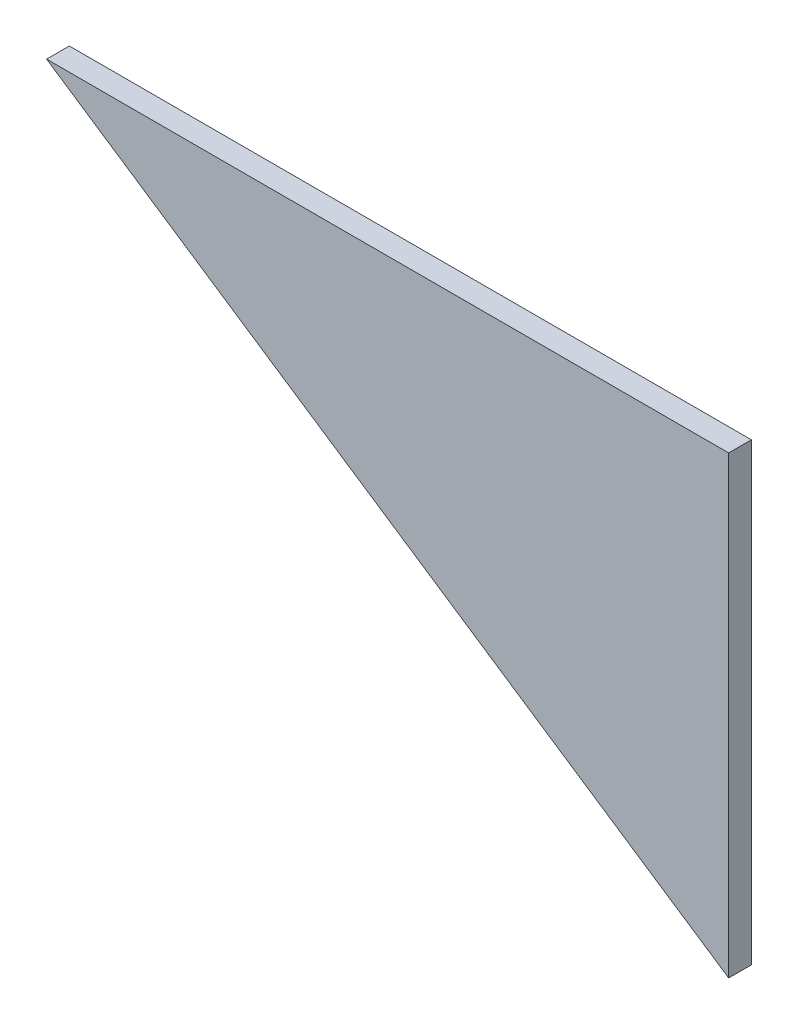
ISO-10303-21;
HEADER;
FILE_DESCRIPTION(('STEP AP214'),'2;1');
FILE_NAME('part.step','',(''),(''),'','','');
FILE_SCHEMA(('AUTOMOTIVE_DESIGN { 1 0 10303 214 1 1 1 1 }'));
ENDSEC;
DATA;
#1=APPLICATION_CONTEXT('core data for automotive mechanical design processes');
#2=APPLICATION_PROTOCOL_DEFINITION('international standard','automotive_design',2000,#1);
#3=PRODUCT_CONTEXT('',#1,'mechanical');
#4=PRODUCT('Part','Part','',(#3));
#5=PRODUCT_RELATED_PRODUCT_CATEGORY('part','',(#4));
#6=PRODUCT_DEFINITION_FORMATION('','',#4);
#7=PRODUCT_DEFINITION_CONTEXT('part definition',#1,'design');
#8=PRODUCT_DEFINITION('design','',#6,#7);
#9=PRODUCT_DEFINITION_SHAPE('','',#8);
#10=(LENGTH_UNIT() NAMED_UNIT(*) SI_UNIT(.MILLI.,.METRE.));
#11=(NAMED_UNIT(*) PLANE_ANGLE_UNIT() SI_UNIT($,.RADIAN.));
#12=(NAMED_UNIT(*) SI_UNIT($,.STERADIAN.) SOLID_ANGLE_UNIT());
#13=UNCERTAINTY_MEASURE_WITH_UNIT(LENGTH_MEASURE(1.E-05),#10,'distance_accuracy_value','');
#14=(GEOMETRIC_REPRESENTATION_CONTEXT(3) GLOBAL_UNCERTAINTY_ASSIGNED_CONTEXT((#13)) GLOBAL_UNIT_ASSIGNED_CONTEXT((#10,
#11,#12)) REPRESENTATION_CONTEXT('',''));
#15=CARTESIAN_POINT('',(0.,0.,0.));
#16=DIRECTION('',(0.,0.,1.));
#17=DIRECTION('',(1.,0.,0.));
#18=AXIS2_PLACEMENT_3D('',#15,#16,#17);
#19=CARTESIAN_POINT('',(0.,100.,5.));
#20=DIRECTION('',(-1.,0.,0.));
#21=DIRECTION('',(0.,-1.,0.));
#22=AXIS2_PLACEMENT_3D('',#19,#20,#21);
#23=PLANE('',#22);
#24=DIRECTION('',(0.,1.,0.));
#25=VECTOR('',#24,1.);
#26=CARTESIAN_POINT('',(0.,100.,0.));
#27=LINE('',#26,#25);
#28=CARTESIAN_POINT('',(0.,0.,0.));
#29=VERTEX_POINT('',#28);
#30=CARTESIAN_POINT('',(0.,100.,0.));
#31=VERTEX_POINT('',#30);
#32=EDGE_CURVE('E85',#29,#31,#27,.T.);
#33=ORIENTED_EDGE('',*,*,#32,.T.);
#34=DIRECTION('',(0.,0.,-1.));
#35=VECTOR('',#34,1.);
#36=CARTESIAN_POINT('',(0.,100.,5.));
#37=LINE('',#36,#35);
#38=CARTESIAN_POINT('',(0.,100.,5.));
#39=VERTEX_POINT('',#38);
#40=EDGE_CURVE('E11',#39,#31,#37,.T.);
#41=ORIENTED_EDGE('',*,*,#40,.F.);
#42=DIRECTION('',(0.,1.,0.));
#43=VECTOR('',#42,1.);
#44=CARTESIAN_POINT('',(0.,100.,5.));
#45=LINE('',#44,#43);
#46=CARTESIAN_POINT('',(0.,0.,5.));
#47=VERTEX_POINT('',#46);
#48=EDGE_CURVE('E78',#47,#39,#45,.T.);
#49=ORIENTED_EDGE('',*,*,#48,.F.);
#50=DIRECTION('',(0.,0.,-1.));
#51=VECTOR('',#50,1.);
#52=CARTESIAN_POINT('',(0.,0.,5.));
#53=LINE('',#52,#51);
#54=EDGE_CURVE('E86',#47,#29,#53,.T.);
#55=ORIENTED_EDGE('',*,*,#54,.T.);
#56=EDGE_LOOP('',(#33,#41,#49,#55));
#57=FACE_BOUND('',#56,.T.);
#58=ADVANCED_FACE('F38',(#57),#23,.F.);
#59=CARTESIAN_POINT('',(-150.,100.,5.));
#60=DIRECTION('',(0.,-1.,0.));
#61=DIRECTION('',(0.,0.,-1.));
#62=AXIS2_PLACEMENT_3D('',#59,#60,#61);
#63=PLANE('',#62);
#64=DIRECTION('',(-1.,0.,0.));
#65=VECTOR('',#64,1.);
#66=CARTESIAN_POINT('',(-150.,100.,0.));
#67=LINE('',#66,#65);
#68=CARTESIAN_POINT('',(-150.,100.,0.));
#69=VERTEX_POINT('',#68);
#70=EDGE_CURVE('E66',#31,#69,#67,.T.);
#71=ORIENTED_EDGE('',*,*,#70,.T.);
#72=DIRECTION('',(0.,0.,-1.));
#73=VECTOR('',#72,1.);
#74=CARTESIAN_POINT('',(-150.,100.,5.));
#75=LINE('',#74,#73);
#76=CARTESIAN_POINT('',(-150.,100.,5.));
#77=VERTEX_POINT('',#76);
#78=EDGE_CURVE('E46',#77,#69,#75,.T.);
#79=ORIENTED_EDGE('',*,*,#78,.F.);
#80=DIRECTION('',(-1.,0.,0.));
#81=VECTOR('',#80,1.);
#82=CARTESIAN_POINT('',(-150.,100.,5.));
#83=LINE('',#82,#81);
#84=EDGE_CURVE('E74',#39,#77,#83,.T.);
#85=ORIENTED_EDGE('',*,*,#84,.F.);
#86=ORIENTED_EDGE('',*,*,#40,.T.);
#87=EDGE_LOOP('',(#71,#79,#85,#86));
#88=FACE_BOUND('',#87,.T.);
#89=ADVANCED_FACE('F75',(#88),#63,.F.);
#90=CARTESIAN_POINT('',(0.,0.,5.));
#91=DIRECTION('',(0.554700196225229,0.832050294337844,0.));
#92=DIRECTION('',(-0.832050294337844,0.554700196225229,0.));
#93=AXIS2_PLACEMENT_3D('',#90,#91,#92);
#94=PLANE('',#93);
#95=DIRECTION('',(0.832050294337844,-0.554700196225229,0.));
#96=VECTOR('',#95,1.);
#97=CARTESIAN_POINT('',(0.,0.,0.));
#98=LINE('',#97,#96);
#99=EDGE_CURVE('E71',#69,#29,#98,.T.);
#100=ORIENTED_EDGE('',*,*,#99,.T.);
#101=ORIENTED_EDGE('',*,*,#54,.F.);
#102=DIRECTION('',(0.832050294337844,-0.554700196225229,0.));
#103=VECTOR('',#102,1.);
#104=CARTESIAN_POINT('',(0.,0.,5.));
#105=LINE('',#104,#103);
#106=EDGE_CURVE('E54',#77,#47,#105,.T.);
#107=ORIENTED_EDGE('',*,*,#106,.F.);
#108=ORIENTED_EDGE('',*,*,#78,.T.);
#109=EDGE_LOOP('',(#100,#101,#107,#108));
#110=FACE_BOUND('',#109,.T.);
#111=ADVANCED_FACE('F93',(#110),#94,.F.);
#112=CARTESIAN_POINT('',(0.,0.,5.));
#113=DIRECTION('',(0.,0.,1.));
#114=DIRECTION('',(1.,0.,0.));
#115=AXIS2_PLACEMENT_3D('',#112,#113,#114);
#116=PLANE('',#115);
#117=ORIENTED_EDGE('',*,*,#48,.T.);
#118=ORIENTED_EDGE('',*,*,#84,.T.);
#119=ORIENTED_EDGE('',*,*,#106,.T.);
#120=EDGE_LOOP('',(#117,#118,#119));
#121=FACE_BOUND('',#120,.T.);
#122=ADVANCED_FACE('F81',(#121),#116,.T.);
#123=CARTESIAN_POINT('',(0.,0.,0.));
#124=DIRECTION('',(0.,0.,1.));
#125=DIRECTION('',(1.,0.,0.));
#126=AXIS2_PLACEMENT_3D('',#123,#124,#125);
#127=PLANE('',#126);
#128=ORIENTED_EDGE('',*,*,#32,.F.);
#129=ORIENTED_EDGE('',*,*,#99,.F.);
#130=ORIENTED_EDGE('',*,*,#70,.F.);
#131=EDGE_LOOP('',(#128,#129,#130));
#132=FACE_BOUND('',#131,.T.);
#133=ADVANCED_FACE('F94',(#132),#127,.F.);
#134=CLOSED_SHELL('',(#58,#89,#111,#122,#133));
#135=MANIFOLD_SOLID_BREP('B2',#134);
#136=ADVANCED_BREP_SHAPE_REPRESENTATION('',(#18,#135),#14);
#137=SHAPE_DEFINITION_REPRESENTATION(#9,#136);
ENDSEC;
END-ISO-10303-21;
